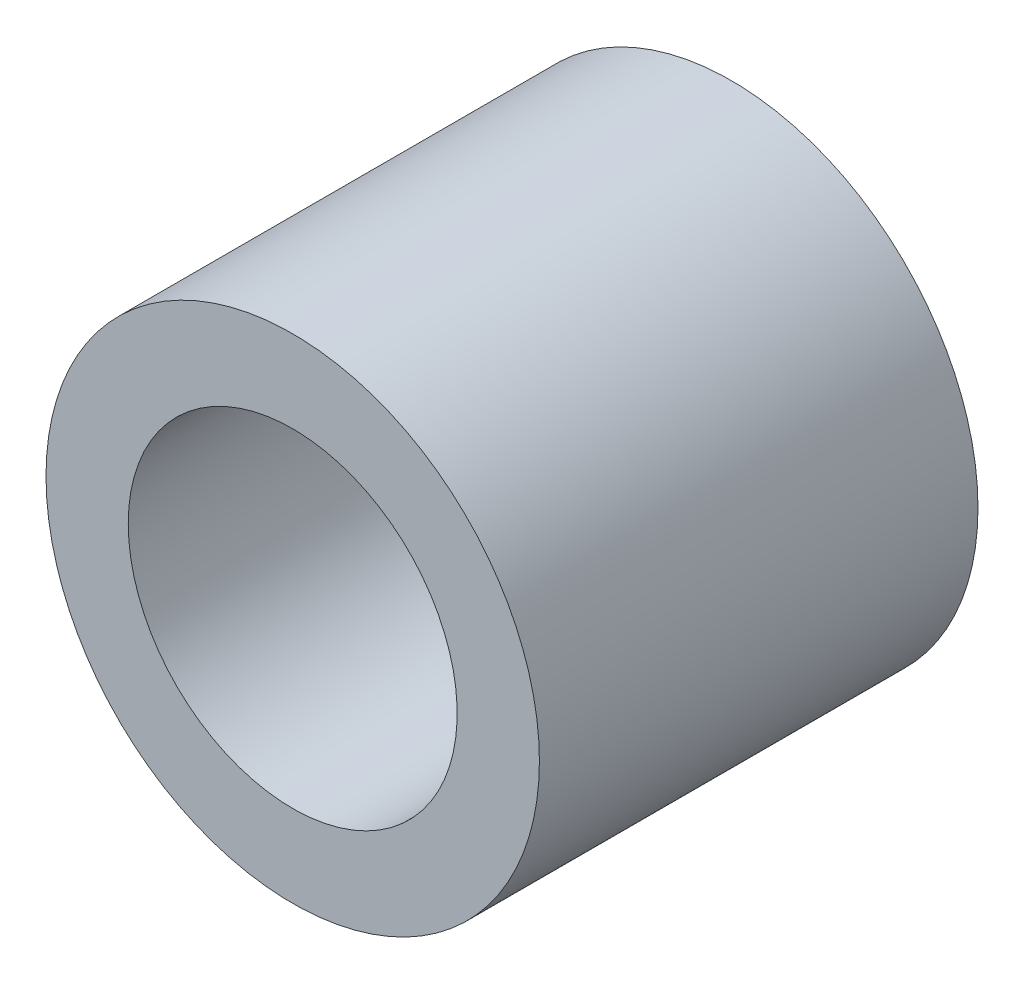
ISO-10303-21;
HEADER;
FILE_DESCRIPTION(('STEP AP214'),'2;1');
FILE_NAME('part.step','',(''),(''),'','','');
FILE_SCHEMA(('AUTOMOTIVE_DESIGN { 1 0 10303 214 1 1 1 1 }'));
ENDSEC;
DATA;
#1=APPLICATION_CONTEXT('core data for automotive mechanical design processes');
#2=APPLICATION_PROTOCOL_DEFINITION('international standard','automotive_design',2000,#1);
#3=PRODUCT_CONTEXT('',#1,'mechanical');
#4=PRODUCT('Part','Part','',(#3));
#5=PRODUCT_RELATED_PRODUCT_CATEGORY('part','',(#4));
#6=PRODUCT_DEFINITION_FORMATION('','',#4);
#7=PRODUCT_DEFINITION_CONTEXT('part definition',#1,'design');
#8=PRODUCT_DEFINITION('design','',#6,#7);
#9=PRODUCT_DEFINITION_SHAPE('','',#8);
#10=(LENGTH_UNIT() NAMED_UNIT(*) SI_UNIT(.MILLI.,.METRE.));
#11=(NAMED_UNIT(*) PLANE_ANGLE_UNIT() SI_UNIT($,.RADIAN.));
#12=(NAMED_UNIT(*) SI_UNIT($,.STERADIAN.) SOLID_ANGLE_UNIT());
#13=UNCERTAINTY_MEASURE_WITH_UNIT(LENGTH_MEASURE(1.E-05),#10,'distance_accuracy_value','');
#14=(GEOMETRIC_REPRESENTATION_CONTEXT(3) GLOBAL_UNCERTAINTY_ASSIGNED_CONTEXT((#13)) GLOBAL_UNIT_ASSIGNED_CONTEXT((#10,
#11,#12)) REPRESENTATION_CONTEXT('',''));
#15=CARTESIAN_POINT('',(0.,0.,0.));
#16=DIRECTION('',(0.,0.,1.));
#17=DIRECTION('',(1.,0.,0.));
#18=AXIS2_PLACEMENT_3D('',#15,#16,#17);
#19=CARTESIAN_POINT('',(0.,0.,16.));
#20=DIRECTION('',(0.,0.,0.999999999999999));
#21=DIRECTION('',(1.,0.,0.));
#22=AXIS2_PLACEMENT_3D('',#19,#20,#21);
#23=PLANE('',#22);
#24=CARTESIAN_POINT('',(0.,0.,16.));
#25=DIRECTION('',(0.,0.,0.999999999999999));
#26=DIRECTION('',(1.,0.,0.));
#27=AXIS2_PLACEMENT_3D('',#24,#25,#26);
#28=CIRCLE('',#27,9.);
#29=CARTESIAN_POINT('',(-9.00000000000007,0.,16.));
#30=VERTEX_POINT('',#29);
#31=EDGE_CURVE('E10',#30,#30,#28,.T.);
#32=ORIENTED_EDGE('',*,*,#31,.T.);
#33=EDGE_LOOP('',(#32));
#34=FACE_BOUND('',#33,.T.);
#35=CARTESIAN_POINT('',(0.,0.,16.));
#36=DIRECTION('',(0.,0.,0.999999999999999));
#37=DIRECTION('',(1.,0.,0.));
#38=AXIS2_PLACEMENT_3D('',#35,#36,#37);
#39=CIRCLE('',#38,6.);
#40=CARTESIAN_POINT('',(-6.00000000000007,0.,16.));
#41=VERTEX_POINT('',#40);
#42=EDGE_CURVE('E39',#41,#41,#39,.T.);
#43=ORIENTED_EDGE('',*,*,#42,.F.);
#44=EDGE_LOOP('',(#43));
#45=FACE_BOUND('',#44,.T.);
#46=ADVANCED_FACE('F28',(#34,#45),#23,.T.);
#47=CARTESIAN_POINT('',(1.11022302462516E-13,0.,0.));
#48=DIRECTION('',(0.,0.,0.999999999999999));
#49=DIRECTION('',(1.,0.,0.));
#50=AXIS2_PLACEMENT_3D('',#47,#48,#49);
#51=PLANE('',#50);
#52=CARTESIAN_POINT('',(1.11022302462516E-13,0.,0.));
#53=DIRECTION('',(0.,0.,0.999999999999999));
#54=DIRECTION('',(1.,0.,0.));
#55=AXIS2_PLACEMENT_3D('',#52,#53,#54);
#56=CIRCLE('',#55,9.);
#57=CARTESIAN_POINT('',(-9.00000000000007,0.,0.));
#58=VERTEX_POINT('',#57);
#59=EDGE_CURVE('E35',#58,#58,#56,.T.);
#60=ORIENTED_EDGE('',*,*,#59,.F.);
#61=EDGE_LOOP('',(#60));
#62=FACE_BOUND('',#61,.T.);
#63=CARTESIAN_POINT('',(1.11022302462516E-13,0.,0.));
#64=DIRECTION('',(0.,0.,0.999999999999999));
#65=DIRECTION('',(1.,0.,0.));
#66=AXIS2_PLACEMENT_3D('',#63,#64,#65);
#67=CIRCLE('',#66,6.);
#68=CARTESIAN_POINT('',(-6.00000000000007,0.,0.));
#69=VERTEX_POINT('',#68);
#70=EDGE_CURVE('E43',#69,#69,#67,.T.);
#71=ORIENTED_EDGE('',*,*,#70,.T.);
#72=EDGE_LOOP('',(#71));
#73=FACE_BOUND('',#72,.T.);
#74=ADVANCED_FACE('F49',(#62,#73),#51,.F.);
#75=CARTESIAN_POINT('',(0.,0.,16.));
#76=DIRECTION('',(0.,0.,-0.999999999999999));
#77=DIRECTION('',(-1.,0.,0.));
#78=AXIS2_PLACEMENT_3D('',#75,#76,#77);
#79=CYLINDRICAL_SURFACE('',#78,9.);
#80=CARTESIAN_POINT('',(-9.00000000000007,0.,16.));
#81=CARTESIAN_POINT('',(-9.00000000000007,0.,15.8333333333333));
#82=CARTESIAN_POINT('',(-9.00000000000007,0.,15.6666666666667));
#83=CARTESIAN_POINT('',(-9.00000000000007,0.,15.3333333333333));
#84=CARTESIAN_POINT('',(-9.00000000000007,0.,15.1666666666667));
#85=CARTESIAN_POINT('',(-9.00000000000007,0.,14.8333333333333));
#86=CARTESIAN_POINT('',(-9.00000000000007,0.,14.6666666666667));
#87=CARTESIAN_POINT('',(-9.00000000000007,0.,14.3333333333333));
#88=CARTESIAN_POINT('',(-9.00000000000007,0.,14.1666666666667));
#89=CARTESIAN_POINT('',(-9.00000000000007,0.,13.8333333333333));
#90=CARTESIAN_POINT('',(-9.00000000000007,0.,13.6666666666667));
#91=CARTESIAN_POINT('',(-9.00000000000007,0.,13.3333333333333));
#92=CARTESIAN_POINT('',(-9.00000000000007,0.,13.1666666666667));
#93=CARTESIAN_POINT('',(-9.00000000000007,0.,12.8333333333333));
#94=CARTESIAN_POINT('',(-9.00000000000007,0.,12.6666666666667));
#95=CARTESIAN_POINT('',(-9.00000000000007,0.,12.3333333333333));
#96=CARTESIAN_POINT('',(-9.00000000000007,0.,12.1666666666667));
#97=CARTESIAN_POINT('',(-9.00000000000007,0.,11.8333333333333));
#98=CARTESIAN_POINT('',(-9.00000000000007,0.,11.6666666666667));
#99=CARTESIAN_POINT('',(-9.00000000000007,0.,11.3333333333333));
#100=CARTESIAN_POINT('',(-9.00000000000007,0.,11.1666666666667));
#101=CARTESIAN_POINT('',(-9.00000000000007,0.,10.8333333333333));
#102=CARTESIAN_POINT('',(-9.00000000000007,0.,10.6666666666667));
#103=CARTESIAN_POINT('',(-9.00000000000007,0.,10.3333333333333));
#104=CARTESIAN_POINT('',(-9.00000000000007,0.,10.1666666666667));
#105=CARTESIAN_POINT('',(-9.00000000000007,0.,9.83333333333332));
#106=CARTESIAN_POINT('',(-9.00000000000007,0.,9.66666666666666));
#107=CARTESIAN_POINT('',(-9.00000000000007,0.,9.33333333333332));
#108=CARTESIAN_POINT('',(-9.00000000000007,0.,9.16666666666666));
#109=CARTESIAN_POINT('',(-9.00000000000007,0.,8.83333333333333));
#110=CARTESIAN_POINT('',(-9.00000000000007,0.,8.66666666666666));
#111=CARTESIAN_POINT('',(-9.00000000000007,0.,8.33333333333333));
#112=CARTESIAN_POINT('',(-9.00000000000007,0.,8.16666666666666));
#113=CARTESIAN_POINT('',(-9.00000000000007,0.,7.83333333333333));
#114=CARTESIAN_POINT('',(-9.00000000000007,0.,7.66666666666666));
#115=CARTESIAN_POINT('',(-9.00000000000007,0.,7.33333333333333));
#116=CARTESIAN_POINT('',(-9.00000000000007,0.,7.16666666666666));
#117=CARTESIAN_POINT('',(-9.00000000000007,0.,6.83333333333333));
#118=CARTESIAN_POINT('',(-9.00000000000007,0.,6.66666666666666));
#119=CARTESIAN_POINT('',(-9.00000000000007,0.,6.33333333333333));
#120=CARTESIAN_POINT('',(-9.00000000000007,0.,6.16666666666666));
#121=CARTESIAN_POINT('',(-9.00000000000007,0.,5.83333333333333));
#122=CARTESIAN_POINT('',(-9.00000000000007,0.,5.66666666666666));
#123=CARTESIAN_POINT('',(-9.00000000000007,0.,5.33333333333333));
#124=CARTESIAN_POINT('',(-9.00000000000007,0.,5.16666666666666));
#125=CARTESIAN_POINT('',(-9.00000000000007,0.,4.83333333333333));
#126=CARTESIAN_POINT('',(-9.00000000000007,0.,4.66666666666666));
#127=CARTESIAN_POINT('',(-9.00000000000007,0.,4.33333333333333));
#128=CARTESIAN_POINT('',(-9.00000000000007,0.,4.16666666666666));
#129=CARTESIAN_POINT('',(-9.00000000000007,0.,3.83333333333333));
#130=CARTESIAN_POINT('',(-9.00000000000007,0.,3.66666666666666));
#131=CARTESIAN_POINT('',(-9.00000000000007,0.,3.33333333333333));
#132=CARTESIAN_POINT('',(-9.00000000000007,0.,3.16666666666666));
#133=CARTESIAN_POINT('',(-9.00000000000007,0.,2.83333333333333));
#134=CARTESIAN_POINT('',(-9.00000000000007,0.,2.66666666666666));
#135=CARTESIAN_POINT('',(-9.00000000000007,0.,2.33333333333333));
#136=CARTESIAN_POINT('',(-9.00000000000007,0.,2.16666666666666));
#137=CARTESIAN_POINT('',(-9.00000000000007,0.,1.83333333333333));
#138=CARTESIAN_POINT('',(-9.00000000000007,0.,1.66666666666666));
#139=CARTESIAN_POINT('',(-9.00000000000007,0.,1.33333333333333));
#140=CARTESIAN_POINT('',(-9.00000000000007,0.,1.16666666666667));
#141=CARTESIAN_POINT('',(-9.00000000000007,0.,0.833333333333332));
#142=CARTESIAN_POINT('',(-9.00000000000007,0.,0.666666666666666));
#143=CARTESIAN_POINT('',(-9.00000000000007,0.,0.333333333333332));
#144=CARTESIAN_POINT('',(-9.00000000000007,0.,0.166666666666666));
#145=CARTESIAN_POINT('',(-9.00000000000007,0.,0.));
#146=B_SPLINE_CURVE_WITH_KNOTS('',3,(#80,#81,#82,#83,#84,#85,#86,#87,#88,#89,#90,#91,#92,#93,
#94,#95,#96,#97,#98,#99,#100,#101,#102,#103,#104,#105,#106,#107,#108,#109,#110,#111,#112,#113,
#114,#115,#116,#117,#118,#119,#120,#121,#122,#123,#124,#125,#126,#127,#128,#129,#130,#131,#132,
#133,#134,#135,#136,#137,#138,#139,#140,#141,#142,#143,#144,#145),.UNSPECIFIED.,.F.,.F.,(4,2,2,
2,2,2,2,2,2,2,2,2,2,2,2,2,2,2,2,2,2,2,2,2,2,2,2,2,2,2,2,2,4),(0.,0.5,1.,1.5,2.,2.5,3.,3.5,4.,
4.5,5.,5.5,6.,6.5,7.,7.49999999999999,7.99999999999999,8.49999999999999,8.99999999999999,
9.49999999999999,9.99999999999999,10.5,11.,11.5,12.,12.5,13.,13.5,14.,14.5,15.,15.5,16.),.UNSPECIFIED.);
#147=EDGE_CURVE('BSEAM30',#30,#58,#146,.T.);
#148=ORIENTED_EDGE('',*,*,#31,.F.);
#149=ORIENTED_EDGE('',*,*,#59,.T.);
#150=ORIENTED_EDGE('',*,*,#147,.T.);
#151=ORIENTED_EDGE('',*,*,#147,.F.);
#152=EDGE_LOOP('',(#148,#150,#149,#151));
#153=FACE_BOUND('',#152,.T.);
#154=ADVANCED_FACE('F30',(#153),#79,.T.);
#155=CARTESIAN_POINT('',(0.,0.,16.));
#156=DIRECTION('',(0.,0.,-0.999999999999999));
#157=DIRECTION('',(-1.,0.,0.));
#158=AXIS2_PLACEMENT_3D('',#155,#156,#157);
#159=CYLINDRICAL_SURFACE('',#158,6.);
#160=CARTESIAN_POINT('',(-6.00000000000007,0.,16.));
#161=CARTESIAN_POINT('',(-6.00000000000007,0.,15.8333333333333));
#162=CARTESIAN_POINT('',(-6.00000000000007,0.,15.6666666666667));
#163=CARTESIAN_POINT('',(-6.00000000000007,0.,15.3333333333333));
#164=CARTESIAN_POINT('',(-6.00000000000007,0.,15.1666666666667));
#165=CARTESIAN_POINT('',(-6.00000000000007,0.,14.8333333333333));
#166=CARTESIAN_POINT('',(-6.00000000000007,0.,14.6666666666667));
#167=CARTESIAN_POINT('',(-6.00000000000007,0.,14.3333333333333));
#168=CARTESIAN_POINT('',(-6.00000000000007,0.,14.1666666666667));
#169=CARTESIAN_POINT('',(-6.00000000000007,0.,13.8333333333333));
#170=CARTESIAN_POINT('',(-6.00000000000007,0.,13.6666666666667));
#171=CARTESIAN_POINT('',(-6.00000000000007,0.,13.3333333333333));
#172=CARTESIAN_POINT('',(-6.00000000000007,0.,13.1666666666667));
#173=CARTESIAN_POINT('',(-6.00000000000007,0.,12.8333333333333));
#174=CARTESIAN_POINT('',(-6.00000000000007,0.,12.6666666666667));
#175=CARTESIAN_POINT('',(-6.00000000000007,0.,12.3333333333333));
#176=CARTESIAN_POINT('',(-6.00000000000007,0.,12.1666666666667));
#177=CARTESIAN_POINT('',(-6.00000000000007,0.,11.8333333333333));
#178=CARTESIAN_POINT('',(-6.00000000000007,0.,11.6666666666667));
#179=CARTESIAN_POINT('',(-6.00000000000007,0.,11.3333333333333));
#180=CARTESIAN_POINT('',(-6.00000000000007,0.,11.1666666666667));
#181=CARTESIAN_POINT('',(-6.00000000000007,0.,10.8333333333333));
#182=CARTESIAN_POINT('',(-6.00000000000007,0.,10.6666666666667));
#183=CARTESIAN_POINT('',(-6.00000000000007,0.,10.3333333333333));
#184=CARTESIAN_POINT('',(-6.00000000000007,0.,10.1666666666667));
#185=CARTESIAN_POINT('',(-6.00000000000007,0.,9.83333333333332));
#186=CARTESIAN_POINT('',(-6.00000000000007,0.,9.66666666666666));
#187=CARTESIAN_POINT('',(-6.00000000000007,0.,9.33333333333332));
#188=CARTESIAN_POINT('',(-6.00000000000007,0.,9.16666666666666));
#189=CARTESIAN_POINT('',(-6.00000000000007,0.,8.83333333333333));
#190=CARTESIAN_POINT('',(-6.00000000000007,0.,8.66666666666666));
#191=CARTESIAN_POINT('',(-6.00000000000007,0.,8.33333333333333));
#192=CARTESIAN_POINT('',(-6.00000000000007,0.,8.16666666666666));
#193=CARTESIAN_POINT('',(-6.00000000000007,0.,7.83333333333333));
#194=CARTESIAN_POINT('',(-6.00000000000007,0.,7.66666666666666));
#195=CARTESIAN_POINT('',(-6.00000000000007,0.,7.33333333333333));
#196=CARTESIAN_POINT('',(-6.00000000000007,0.,7.16666666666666));
#197=CARTESIAN_POINT('',(-6.00000000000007,0.,6.83333333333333));
#198=CARTESIAN_POINT('',(-6.00000000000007,0.,6.66666666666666));
#199=CARTESIAN_POINT('',(-6.00000000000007,0.,6.33333333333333));
#200=CARTESIAN_POINT('',(-6.00000000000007,0.,6.16666666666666));
#201=CARTESIAN_POINT('',(-6.00000000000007,0.,5.83333333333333));
#202=CARTESIAN_POINT('',(-6.00000000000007,0.,5.66666666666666));
#203=CARTESIAN_POINT('',(-6.00000000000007,0.,5.33333333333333));
#204=CARTESIAN_POINT('',(-6.00000000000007,0.,5.16666666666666));
#205=CARTESIAN_POINT('',(-6.00000000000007,0.,4.83333333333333));
#206=CARTESIAN_POINT('',(-6.00000000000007,0.,4.66666666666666));
#207=CARTESIAN_POINT('',(-6.00000000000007,0.,4.33333333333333));
#208=CARTESIAN_POINT('',(-6.00000000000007,0.,4.16666666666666));
#209=CARTESIAN_POINT('',(-6.00000000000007,0.,3.83333333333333));
#210=CARTESIAN_POINT('',(-6.00000000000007,0.,3.66666666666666));
#211=CARTESIAN_POINT('',(-6.00000000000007,0.,3.33333333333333));
#212=CARTESIAN_POINT('',(-6.00000000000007,0.,3.16666666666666));
#213=CARTESIAN_POINT('',(-6.00000000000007,0.,2.83333333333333));
#214=CARTESIAN_POINT('',(-6.00000000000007,0.,2.66666666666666));
#215=CARTESIAN_POINT('',(-6.00000000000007,0.,2.33333333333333));
#216=CARTESIAN_POINT('',(-6.00000000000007,0.,2.16666666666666));
#217=CARTESIAN_POINT('',(-6.00000000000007,0.,1.83333333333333));
#218=CARTESIAN_POINT('',(-6.00000000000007,0.,1.66666666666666));
#219=CARTESIAN_POINT('',(-6.00000000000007,0.,1.33333333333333));
#220=CARTESIAN_POINT('',(-6.00000000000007,0.,1.16666666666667));
#221=CARTESIAN_POINT('',(-6.00000000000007,0.,0.833333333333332));
#222=CARTESIAN_POINT('',(-6.00000000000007,0.,0.666666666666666));
#223=CARTESIAN_POINT('',(-6.00000000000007,0.,0.333333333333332));
#224=CARTESIAN_POINT('',(-6.00000000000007,0.,0.166666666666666));
#225=CARTESIAN_POINT('',(-6.00000000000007,0.,0.));
#226=B_SPLINE_CURVE_WITH_KNOTS('',3,(#160,#161,#162,#163,#164,#165,#166,#167,#168,#169,#170,
#171,#172,#173,#174,#175,#176,#177,#178,#179,#180,#181,#182,#183,#184,#185,#186,#187,#188,#189,
#190,#191,#192,#193,#194,#195,#196,#197,#198,#199,#200,#201,#202,#203,#204,#205,#206,#207,#208,
#209,#210,#211,#212,#213,#214,#215,#216,#217,#218,#219,#220,#221,#222,#223,#224,#225),
.UNSPECIFIED.,.F.,.F.,(4,2,2,2,2,2,2,2,2,2,2,2,2,2,2,2,2,2,2,2,2,2,2,2,2,2,2,2,2,2,2,2,4),(0.,
0.5,1.,1.5,2.,2.5,3.,3.5,4.,4.5,5.,5.5,6.,6.5,7.,7.49999999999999,7.99999999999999,
8.49999999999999,8.99999999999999,9.49999999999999,9.99999999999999,10.5,11.,11.5,12.,12.5,13.,
13.5,14.,14.5,15.,15.5,16.),.UNSPECIFIED.);
#227=EDGE_CURVE('BSEAM51',#41,#69,#226,.T.);
#228=ORIENTED_EDGE('',*,*,#42,.T.);
#229=ORIENTED_EDGE('',*,*,#70,.F.);
#230=ORIENTED_EDGE('',*,*,#227,.T.);
#231=ORIENTED_EDGE('',*,*,#227,.F.);
#232=EDGE_LOOP('',(#228,#230,#229,#231));
#233=FACE_BOUND('',#232,.T.);
#234=ADVANCED_FACE('F51',(#233),#159,.F.);
#235=CLOSED_SHELL('',(#46,#74,#154,#234));
#236=MANIFOLD_SOLID_BREP('B2',#235);
#237=ADVANCED_BREP_SHAPE_REPRESENTATION('',(#18,#236),#14);
#238=SHAPE_DEFINITION_REPRESENTATION(#9,#237);
ENDSEC;
END-ISO-10303-21;
